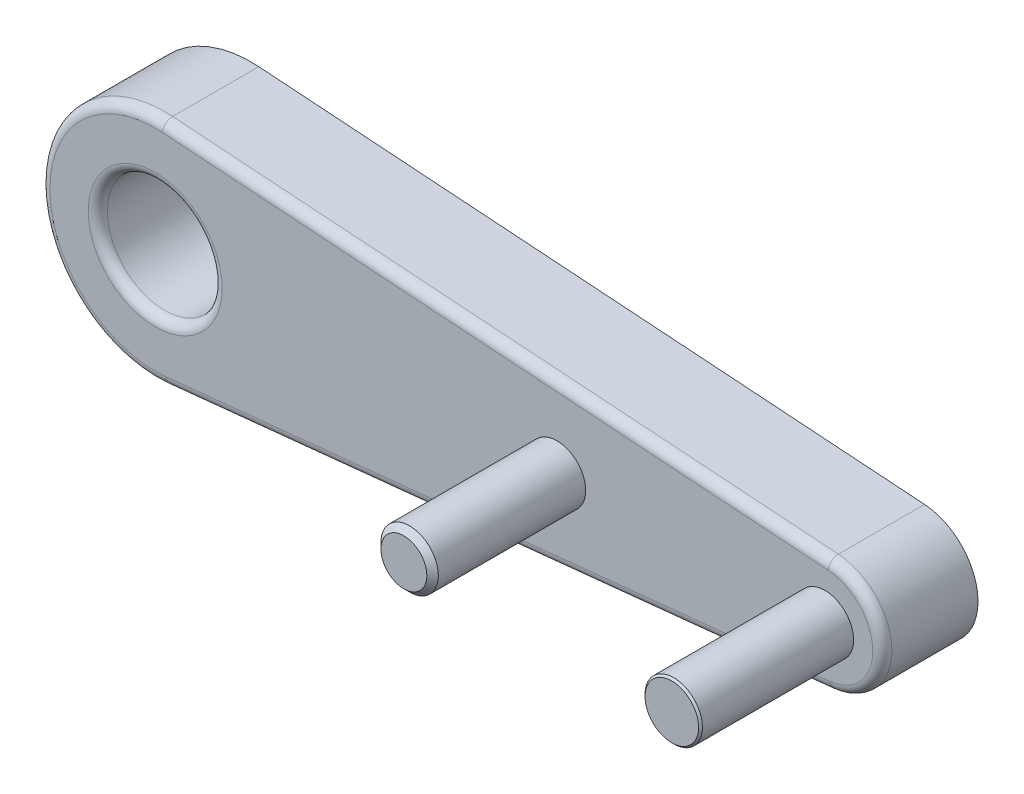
from build123d import *

# Parameters (mm, degrees)
ESQUISSE1_R      = 30
EXTRUSION1_DEPTH = 50
CONG_1_R         = 5
ESQUISSE2_R      = 15
EXTRUSION2_DEPTH = 80
CHANFREIN1_SIZE  = 3
ESQUISSE4_R      = 15
EXTRUSION3_DEPTH = 80
CHANFREIN2_SIZE  = 1


with BuildPart() as part:
    # Esquisse1 → Extrusion1 (new body)
    with BuildSketch(Plane.XY):
        with BuildLine():
            Line((4.154312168, 59.856007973), (352.02936539, 35.711705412))
            ThreePointArc((352.02936539, 35.711705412), (379.94811296, 6.279447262), (353.017208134, -24.05931756))
            Line((353.017208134, -24.05931756), (6.129997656, -59.686037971))
            ThreePointArc((6.129997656, -59.686037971), (-59.99180731, -0.991491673), (4.154312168, 59.856007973))
        make_face()
        Circle(ESQUISSE1_R, mode=Mode.SUBTRACT)
    extrude(amount=EXTRUSION1_DEPTH)

    # Cong_1
    cong_1_edges = [part.edges().sort_by_distance(p)[0] for p in [
        (379.94811296, 6.279447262, 50),
        (-30, 0, 50),
        (178.091838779, 47.783856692, 50),
        (-59.99180731, -0.991491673, 50),
        (179.573602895, -41.872677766, 50),
    ]]
    fillet(cong_1_edges, radius=CONG_1_R)

    # Esquisse2 → Extrusion2 (add)
    with BuildSketch(Plane.XY.offset(50)):
        with Locations((209.952209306, 3.469904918)):
            Circle(ESQUISSE2_R)
    extrude(amount=EXTRUSION2_DEPTH)

    # Chanfrein1
    chanfrein1_edges = [part.edges().sort_by_distance(p)[0] for p in [
        (194.952209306, 3.469904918, 130),
    ]]
    chamfer(chanfrein1_edges, length=CHANFREIN1_SIZE)

    # Esquisse4 → Extrusion3 (add)
    with BuildSketch(Plane.XY.offset(50)):
        with Locations((349.952209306, 5.783701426)):
            Circle(ESQUISSE4_R)
    extrude(amount=EXTRUSION3_DEPTH)

    # Chanfrein2
    chanfrein2_edges = [part.edges().sort_by_distance(p)[0] for p in [
        (334.952209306, 5.783701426, 130),
    ]]
    chamfer(chanfrein2_edges, length=CHANFREIN2_SIZE)


solid = part.part
